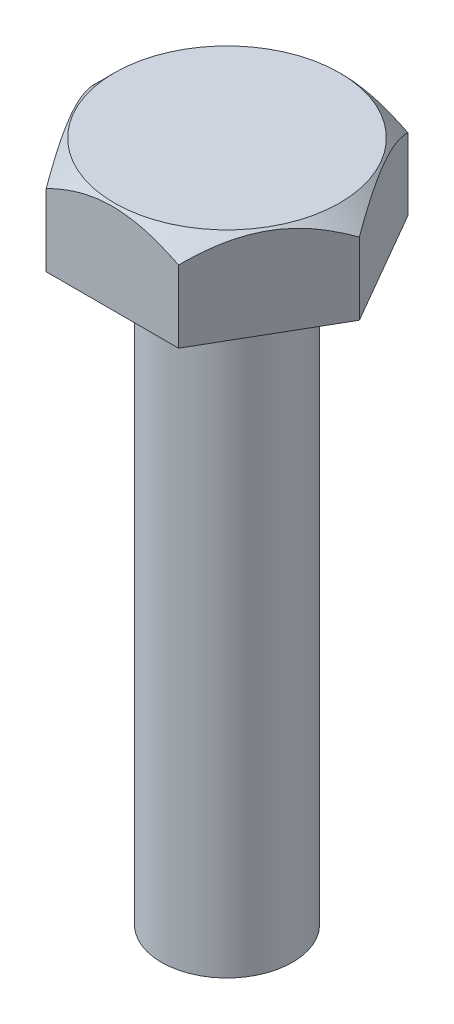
ISO-10303-21;
HEADER;
FILE_DESCRIPTION(('STEP AP214'),'2;1');
FILE_NAME('part.step','',(''),(''),'','','');
FILE_SCHEMA(('AUTOMOTIVE_DESIGN { 1 0 10303 214 1 1 1 1 }'));
ENDSEC;
DATA;
#1=APPLICATION_CONTEXT('core data for automotive mechanical design processes');
#2=APPLICATION_PROTOCOL_DEFINITION('international standard','automotive_design',2000,#1);
#3=PRODUCT_CONTEXT('',#1,'mechanical');
#4=PRODUCT('Part','Part','',(#3));
#5=PRODUCT_RELATED_PRODUCT_CATEGORY('part','',(#4));
#6=PRODUCT_DEFINITION_FORMATION('','',#4);
#7=PRODUCT_DEFINITION_CONTEXT('part definition',#1,'design');
#8=PRODUCT_DEFINITION('design','',#6,#7);
#9=PRODUCT_DEFINITION_SHAPE('','',#8);
#10=(LENGTH_UNIT() NAMED_UNIT(*) SI_UNIT(.MILLI.,.METRE.));
#11=(NAMED_UNIT(*) PLANE_ANGLE_UNIT() SI_UNIT($,.RADIAN.));
#12=(NAMED_UNIT(*) SI_UNIT($,.STERADIAN.) SOLID_ANGLE_UNIT());
#13=UNCERTAINTY_MEASURE_WITH_UNIT(LENGTH_MEASURE(1.E-05),#10,'distance_accuracy_value','');
#14=(GEOMETRIC_REPRESENTATION_CONTEXT(3) GLOBAL_UNCERTAINTY_ASSIGNED_CONTEXT((#13)) GLOBAL_UNIT_ASSIGNED_CONTEXT((#10,
#11,#12)) REPRESENTATION_CONTEXT('',''));
#15=CARTESIAN_POINT('',(0.,0.,0.));
#16=DIRECTION('',(0.,0.,1.));
#17=DIRECTION('',(1.,0.,0.));
#18=AXIS2_PLACEMENT_3D('',#15,#16,#17);
#19=CARTESIAN_POINT('',(4.04145188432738,20.8,0.));
#20=DIRECTION('',(-0.866025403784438,0.,0.5));
#21=DIRECTION('',(0.5,0.,0.866025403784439));
#22=AXIS2_PLACEMENT_3D('',#19,#20,#21);
#23=PLANE('',#22);
#24=CARTESIAN_POINT('',(4.04156735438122,20.1998845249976,0.000199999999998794));
#25=CARTESIAN_POINT('',(3.9721070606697,20.2692840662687,-0.12010875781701));
#26=CARTESIAN_POINT('',(3.90148531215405,20.3346075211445,-0.242429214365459));
#27=CARTESIAN_POINT('',(3.75747991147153,20.4542129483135,-0.491853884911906));
#28=CARTESIAN_POINT('',(3.68408256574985,20.5084283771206,-0.61898181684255));
#29=CARTESIAN_POINT('',(3.53608035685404,20.6013003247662,-0.875329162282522));
#30=CARTESIAN_POINT('',(3.46151318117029,20.6401902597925,-1.00448329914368));
#31=CARTESIAN_POINT('',(3.310737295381,20.7001080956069,-1.26563479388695));
#32=CARTESIAN_POINT('',(3.2345331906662,20.7211807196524,-1.39762417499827));
#33=CARTESIAN_POINT('',(3.10319782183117,20.7401938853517,-1.62510370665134));
#34=CARTESIAN_POINT('',(3.04823615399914,20.7430083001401,-1.72030010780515));
#35=CARTESIAN_POINT('',(2.93840222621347,20.7382653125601,-1.91053805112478));
#36=CARTESIAN_POINT('',(2.88353000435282,20.730704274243,-2.00557952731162));
#37=CARTESIAN_POINT('',(2.77430542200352,20.7056421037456,-2.19476205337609));
#38=CARTESIAN_POINT('',(2.71995371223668,20.6881298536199,-2.28890197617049));
#39=CARTESIAN_POINT('',(2.61218376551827,20.6441211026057,-2.47556499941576));
#40=CARTESIAN_POINT('',(2.55876545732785,20.6176252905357,-2.56808822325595));
#41=CARTESIAN_POINT('',(2.46393368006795,20.5631120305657,-2.73234167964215));
#42=CARTESIAN_POINT('',(2.42231028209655,20.5365276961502,-2.80443551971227));
#43=CARTESIAN_POINT('',(2.33981072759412,20.4790746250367,-2.94732893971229));
#44=CARTESIAN_POINT('',(2.29893459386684,20.4482057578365,-3.01812848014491));
#45=CARTESIAN_POINT('',(2.21805834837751,20.3828756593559,-3.15821024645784));
#46=CARTESIAN_POINT('',(2.17805593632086,20.348425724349,-3.22749645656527));
#47=CARTESIAN_POINT('',(2.09879193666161,20.2763859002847,-3.36478573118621));
#48=CARTESIAN_POINT('',(2.05952991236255,20.2387979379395,-3.43278955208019));
#49=CARTESIAN_POINT('',(2.02061047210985,20.1998845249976,-3.5002));
#50=B_SPLINE_CURVE_WITH_KNOTS('',3,(#24,#25,#26,#27,#28,#29,#30,#31,#32,#33,#34,#35,#36,#37,#38,
#39,#40,#41,#42,#43,#44,#45,#46,#47,#48,#49),.UNSPECIFIED.,.F.,.F.,(4,2,2,2,2,2,2,2,2,2,2,2,4),
(0.,0.466195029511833,0.93510605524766,1.39657035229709,1.85687285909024,2.18628459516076,
2.5158117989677,2.84570789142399,3.17557869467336,3.43762138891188,3.6996720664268,
3.96091985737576,4.22200840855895),.UNSPECIFIED.);
#51=CARTESIAN_POINT('',(4.04145188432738,20.2,0.));
#52=VERTEX_POINT('',#51);
#53=CARTESIAN_POINT('',(2.02072594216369,20.2,-3.5));
#54=VERTEX_POINT('',#53);
#55=EDGE_CURVE('E88',#52,#54,#50,.T.);
#56=ORIENTED_EDGE('',*,*,#55,.F.);
#57=DIRECTION('',(0.,-1.,0.));
#58=VECTOR('',#57,1.);
#59=CARTESIAN_POINT('',(4.04145188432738,20.8,0.));
#60=LINE('',#59,#58);
#61=CARTESIAN_POINT('',(4.04145188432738,18.,0.));
#62=VERTEX_POINT('',#61);
#63=EDGE_CURVE('E59',#52,#62,#60,.T.);
#64=ORIENTED_EDGE('',*,*,#63,.T.);
#65=DIRECTION('',(-0.5,0.,-0.866025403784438));
#66=VECTOR('',#65,1.);
#67=CARTESIAN_POINT('',(4.04145188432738,18.,0.));
#68=LINE('',#67,#66);
#69=CARTESIAN_POINT('',(2.02072594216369,18.,-3.5));
#70=VERTEX_POINT('',#69);
#71=EDGE_CURVE('E95',#62,#70,#68,.T.);
#72=ORIENTED_EDGE('',*,*,#71,.T.);
#73=DIRECTION('',(0.,-1.,0.));
#74=VECTOR('',#73,1.);
#75=CARTESIAN_POINT('',(2.02072594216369,20.8,-3.5));
#76=LINE('',#75,#74);
#77=EDGE_CURVE('E101',#54,#70,#76,.T.);
#78=ORIENTED_EDGE('',*,*,#77,.F.);
#79=EDGE_LOOP('',(#56,#64,#72,#78));
#80=FACE_BOUND('',#79,.T.);
#81=ADVANCED_FACE('F36',(#80),#23,.F.);
#82=CARTESIAN_POINT('',(2.02072594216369,20.8,-3.5));
#83=DIRECTION('',(0.,0.,1.));
#84=DIRECTION('',(1.,0.,0.));
#85=AXIS2_PLACEMENT_3D('',#82,#83,#84);
#86=PLANE('',#85);
#87=CARTESIAN_POINT('',(-4.19349109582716,18.7792758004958,-3.5));
#88=CARTESIAN_POINT('',(-4.09208669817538,18.8571097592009,-3.5));
#89=CARTESIAN_POINT('',(-3.99013324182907,18.9342396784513,-3.5));
#90=CARTESIAN_POINT('',(-3.78490475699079,19.086770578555,-3.5));
#91=CARTESIAN_POINT('',(-3.68162941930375,19.1621711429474,-3.5));
#92=CARTESIAN_POINT('',(-3.47277876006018,19.3114591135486,-3.5));
#93=CARTESIAN_POINT('',(-3.36719183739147,19.3853303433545,-3.5));
#94=CARTESIAN_POINT('',(-3.15425614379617,19.530479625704,-3.5));
#95=CARTESIAN_POINT('',(-3.04690749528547,19.6017578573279,-3.5));
#96=CARTESIAN_POINT('',(-2.82336801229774,19.7454955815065,-3.5));
#97=CARTESIAN_POINT('',(-2.70704438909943,19.8177496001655,-3.5));
#98=CARTESIAN_POINT('',(-2.47166706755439,19.9577405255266,-3.5));
#99=CARTESIAN_POINT('',(-2.3526129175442,20.0254766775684,-3.5));
#100=CARTESIAN_POINT('',(-2.11174739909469,20.1549869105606,-3.5));
#101=CARTESIAN_POINT('',(-1.9899455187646,20.2167784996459,-3.5));
#102=CARTESIAN_POINT('',(-1.74291320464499,20.3330152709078,-3.5));
#103=CARTESIAN_POINT('',(-1.61768441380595,20.3874639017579,-3.5));
#104=CARTESIAN_POINT('',(-1.37579906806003,20.482239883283,-3.5));
#105=CARTESIAN_POINT('',(-1.25948120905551,20.5234228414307,-3.5));
#106=CARTESIAN_POINT('',(-1.02390221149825,20.5964761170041,-3.5));
#107=CARTESIAN_POINT('',(-0.904640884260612,20.6283458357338,-3.5));
#108=CARTESIAN_POINT('',(-0.665952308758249,20.6805243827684,-3.5));
#109=CARTESIAN_POINT('',(-0.546571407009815,20.7010416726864,-3.5));
#110=CARTESIAN_POINT('',(-0.306352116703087,20.7300907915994,-3.5));
#111=CARTESIAN_POINT('',(-0.185514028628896,20.7386250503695,-3.5));
#112=CARTESIAN_POINT('',(0.0512281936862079,20.7429926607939,-3.5));
#113=CARTESIAN_POINT('',(0.167122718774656,20.7393527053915,-3.5));
#114=CARTESIAN_POINT('',(0.397996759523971,20.7207766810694,-3.5));
#115=CARTESIAN_POINT('',(0.512976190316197,20.7058395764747,-3.5));
#116=CARTESIAN_POINT('',(0.743135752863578,20.665256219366,-3.5));
#117=CARTESIAN_POINT('',(0.858282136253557,20.6394217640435,-3.5));
#118=CARTESIAN_POINT('',(1.08604290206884,20.5784699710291,-3.5));
#119=CARTESIAN_POINT('',(1.19865743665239,20.5433531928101,-3.5));
#120=CARTESIAN_POINT('',(1.42803237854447,20.4629566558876,-3.5));
#121=CARTESIAN_POINT('',(1.54461737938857,20.4171820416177,-3.5));
#122=CARTESIAN_POINT('',(1.77477031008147,20.3185716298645,-3.5));
#123=CARTESIAN_POINT('',(1.88833725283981,20.2657335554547,-3.5));
#124=CARTESIAN_POINT('',(2.11301559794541,20.1542411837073,-3.5));
#125=CARTESIAN_POINT('',(2.22411783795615,20.0955685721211,-3.5));
#126=CARTESIAN_POINT('',(2.44377531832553,19.973701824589,-3.5));
#127=CARTESIAN_POINT('',(2.55233094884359,19.9105083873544,-3.5));
#128=CARTESIAN_POINT('',(2.76191944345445,19.783695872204,-3.5));
#129=CARTESIAN_POINT('',(2.86305896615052,19.7202521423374,-3.5));
#130=CARTESIAN_POINT('',(3.06360047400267,19.5906675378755,-3.5));
#131=CARTESIAN_POINT('',(3.16300232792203,19.5245264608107,-3.5));
#132=CARTESIAN_POINT('',(3.35949586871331,19.3905676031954,-3.5));
#133=CARTESIAN_POINT('',(3.45659970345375,19.3227675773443,-3.5));
#134=CARTESIAN_POINT('',(3.64947574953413,19.1853525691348,-3.5));
#135=CARTESIAN_POINT('',(3.74524832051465,19.1157380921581,-3.5));
#136=CARTESIAN_POINT('',(3.84046254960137,19.0453810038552,-3.5));
#137=B_SPLINE_CURVE_WITH_KNOTS('',3,(#87,#88,#89,#90,#91,#92,#93,#94,#95,#96,#97,#98,#99,#100,
#101,#102,#103,#104,#105,#106,#107,#108,#109,#110,#111,#112,#113,#114,#115,#116,#117,#118,#119,
#120,#121,#122,#123,#124,#125,#126,#127,#128,#129,#130,#131,#132,#133,#134,#135,#136),
.UNSPECIFIED.,.F.,.F.,(4,2,2,2,2,2,2,2,2,2,2,2,2,2,2,2,2,2,2,2,2,2,2,2,4),(0.,0.383502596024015,
0.767096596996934,1.15365209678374,1.54018084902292,1.95091122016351,2.36171002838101,
2.77125931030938,3.1806155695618,3.55047538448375,3.92035897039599,4.28320370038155,
4.64597484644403,4.99325794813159,5.34057289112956,5.69414898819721,6.04770377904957,
6.42316312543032,6.798743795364,7.17554301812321,7.55228413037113,7.91040820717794,
8.26855921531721,8.62383088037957,8.97900462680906),.UNSPECIFIED.);
#138=CARTESIAN_POINT('',(-2.02072594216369,20.2,-3.5));
#139=VERTEX_POINT('',#138);
#140=EDGE_CURVE('E91',#54,#139,#137,.F.);
#141=ORIENTED_EDGE('',*,*,#140,.F.);
#142=ORIENTED_EDGE('',*,*,#77,.T.);
#143=DIRECTION('',(-1.,0.,0.));
#144=VECTOR('',#143,1.);
#145=CARTESIAN_POINT('',(2.02072594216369,18.,-3.5));
#146=LINE('',#145,#144);
#147=CARTESIAN_POINT('',(-2.02072594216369,18.,-3.5));
#148=VERTEX_POINT('',#147);
#149=EDGE_CURVE('E129',#70,#148,#146,.T.);
#150=ORIENTED_EDGE('',*,*,#149,.T.);
#151=DIRECTION('',(0.,-1.,0.));
#152=VECTOR('',#151,1.);
#153=CARTESIAN_POINT('',(-2.02072594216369,20.8,-3.5));
#154=LINE('',#153,#152);
#155=EDGE_CURVE('E103',#139,#148,#154,.T.);
#156=ORIENTED_EDGE('',*,*,#155,.F.);
#157=EDGE_LOOP('',(#141,#142,#150,#156));
#158=FACE_BOUND('',#157,.T.);
#159=ADVANCED_FACE('F99',(#158),#86,.F.);
#160=CARTESIAN_POINT('',(-2.02072594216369,20.8,-3.5));
#161=DIRECTION('',(0.866025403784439,0.,0.5));
#162=DIRECTION('',(0.5,0.,-0.866025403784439));
#163=AXIS2_PLACEMENT_3D('',#160,#161,#162);
#164=PLANE('',#163);
#165=CARTESIAN_POINT('',(-2.02061047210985,20.1998845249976,-3.5002));
#166=CARTESIAN_POINT('',(-2.09007076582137,20.2692840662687,-3.37989124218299));
#167=CARTESIAN_POINT('',(-2.16069251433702,20.3346075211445,-3.25757078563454));
#168=CARTESIAN_POINT('',(-2.30469791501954,20.4542129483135,-3.0081461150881));
#169=CARTESIAN_POINT('',(-2.37809526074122,20.5084283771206,-2.88101818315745));
#170=CARTESIAN_POINT('',(-2.52609746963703,20.6013003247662,-2.62467083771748));
#171=CARTESIAN_POINT('',(-2.60066464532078,20.6401902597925,-2.49551670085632));
#172=CARTESIAN_POINT('',(-2.75144053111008,20.7001080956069,-2.23436520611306));
#173=CARTESIAN_POINT('',(-2.82764463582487,20.7211807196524,-2.10237582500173));
#174=CARTESIAN_POINT('',(-2.9589800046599,20.7401938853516,-1.87489629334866));
#175=CARTESIAN_POINT('',(-3.01394167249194,20.7430083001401,-1.77969989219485));
#176=CARTESIAN_POINT('',(-3.1237756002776,20.7382653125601,-1.58946194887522));
#177=CARTESIAN_POINT('',(-3.17864782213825,20.730704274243,-1.49442047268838));
#178=CARTESIAN_POINT('',(-3.28787240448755,20.7056421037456,-1.30523794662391));
#179=CARTESIAN_POINT('',(-3.34222411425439,20.6881298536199,-1.21109802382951));
#180=CARTESIAN_POINT('',(-3.4499940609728,20.6441211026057,-1.02443500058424));
#181=CARTESIAN_POINT('',(-3.50341236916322,20.6176252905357,-0.931911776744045));
#182=CARTESIAN_POINT('',(-3.59824414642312,20.5631120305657,-0.767658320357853));
#183=CARTESIAN_POINT('',(-3.63986754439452,20.5365276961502,-0.695564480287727));
#184=CARTESIAN_POINT('',(-3.72236709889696,20.4790746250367,-0.552671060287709));
#185=CARTESIAN_POINT('',(-3.76324323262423,20.4482057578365,-0.481871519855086));
#186=CARTESIAN_POINT('',(-3.84411947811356,20.3828756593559,-0.341789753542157));
#187=CARTESIAN_POINT('',(-3.88412189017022,20.348425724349,-0.272503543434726));
#188=CARTESIAN_POINT('',(-3.96338588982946,20.2763859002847,-0.135214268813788));
#189=CARTESIAN_POINT('',(-4.00264791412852,20.2387979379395,-0.0672104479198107));
#190=CARTESIAN_POINT('',(-4.04156735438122,20.1998845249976,0.00020000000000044));
#191=B_SPLINE_CURVE_WITH_KNOTS('',3,(#165,#166,#167,#168,#169,#170,#171,#172,#173,#174,#175,
#176,#177,#178,#179,#180,#181,#182,#183,#184,#185,#186,#187,#188,#189,#190),.UNSPECIFIED.,.F.,
.F.,(4,2,2,2,2,2,2,2,2,2,2,2,4),(0.,0.466195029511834,0.935106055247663,1.3965703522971,
1.85687285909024,2.18628459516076,2.51581179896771,2.84570789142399,3.17557869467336,
3.43762138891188,3.69967206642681,3.96091985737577,4.22200840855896),.UNSPECIFIED.);
#192=CARTESIAN_POINT('',(-4.04145188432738,20.2,0.));
#193=VERTEX_POINT('',#192);
#194=EDGE_CURVE('E104',#139,#193,#191,.T.);
#195=ORIENTED_EDGE('',*,*,#194,.F.);
#196=ORIENTED_EDGE('',*,*,#155,.T.);
#197=DIRECTION('',(-0.5,0.,0.866025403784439));
#198=VECTOR('',#197,1.);
#199=CARTESIAN_POINT('',(-2.02072594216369,18.,-3.5));
#200=LINE('',#199,#198);
#201=CARTESIAN_POINT('',(-4.04145188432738,18.,0.));
#202=VERTEX_POINT('',#201);
#203=EDGE_CURVE('E126',#148,#202,#200,.T.);
#204=ORIENTED_EDGE('',*,*,#203,.T.);
#205=DIRECTION('',(0.,-1.,0.));
#206=VECTOR('',#205,1.);
#207=CARTESIAN_POINT('',(-4.04145188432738,20.8,0.));
#208=LINE('',#207,#206);
#209=EDGE_CURVE('E109',#193,#202,#208,.T.);
#210=ORIENTED_EDGE('',*,*,#209,.F.);
#211=EDGE_LOOP('',(#195,#196,#204,#210));
#212=FACE_BOUND('',#211,.T.);
#213=ADVANCED_FACE('F181',(#212),#164,.F.);
#214=CARTESIAN_POINT('',(-4.04145188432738,20.8,0.));
#215=DIRECTION('',(0.866025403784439,0.,-0.5));
#216=DIRECTION('',(-0.5,0.,-0.866025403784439));
#217=AXIS2_PLACEMENT_3D('',#214,#215,#216);
#218=PLANE('',#217);
#219=CARTESIAN_POINT('',(-4.04156735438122,20.1998845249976,-0.000200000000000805));
#220=CARTESIAN_POINT('',(-3.9721070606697,20.2692840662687,0.120108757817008));
#221=CARTESIAN_POINT('',(-3.90148531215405,20.3346075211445,0.242429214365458));
#222=CARTESIAN_POINT('',(-3.75747991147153,20.4542129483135,0.491853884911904));
#223=CARTESIAN_POINT('',(-3.68408256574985,20.5084283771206,0.618981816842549));
#224=CARTESIAN_POINT('',(-3.53608035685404,20.6013003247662,0.875329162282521));
#225=CARTESIAN_POINT('',(-3.46151318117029,20.6401902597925,1.00448329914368));
#226=CARTESIAN_POINT('',(-3.310737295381,20.7001080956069,1.26563479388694));
#227=CARTESIAN_POINT('',(-3.2345331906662,20.7211807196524,1.39762417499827));
#228=CARTESIAN_POINT('',(-3.10319782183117,20.7401938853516,1.62510370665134));
#229=CARTESIAN_POINT('',(-3.04823615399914,20.7430083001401,1.72030010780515));
#230=CARTESIAN_POINT('',(-2.93840222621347,20.7382653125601,1.91053805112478));
#231=CARTESIAN_POINT('',(-2.88353000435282,20.730704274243,2.00557952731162));
#232=CARTESIAN_POINT('',(-2.77430542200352,20.7056421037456,2.19476205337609));
#233=CARTESIAN_POINT('',(-2.71995371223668,20.6881298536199,2.28890197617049));
#234=CARTESIAN_POINT('',(-2.61218376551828,20.6441211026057,2.47556499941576));
#235=CARTESIAN_POINT('',(-2.55876545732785,20.6176252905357,2.56808822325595));
#236=CARTESIAN_POINT('',(-2.46393368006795,20.5631120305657,2.73234167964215));
#237=CARTESIAN_POINT('',(-2.42231028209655,20.5365276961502,2.80443551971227));
#238=CARTESIAN_POINT('',(-2.33981072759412,20.4790746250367,2.94732893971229));
#239=CARTESIAN_POINT('',(-2.29893459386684,20.4482057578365,3.01812848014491));
#240=CARTESIAN_POINT('',(-2.21805834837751,20.3828756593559,3.15821024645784));
#241=CARTESIAN_POINT('',(-2.17805593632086,20.348425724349,3.22749645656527));
#242=CARTESIAN_POINT('',(-2.09879193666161,20.2763859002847,3.36478573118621));
#243=CARTESIAN_POINT('',(-2.05952991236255,20.2387979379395,3.43278955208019));
#244=CARTESIAN_POINT('',(-2.02061047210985,20.1998845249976,3.5002));
#245=B_SPLINE_CURVE_WITH_KNOTS('',3,(#219,#220,#221,#222,#223,#224,#225,#226,#227,#228,#229,
#230,#231,#232,#233,#234,#235,#236,#237,#238,#239,#240,#241,#242,#243,#244),.UNSPECIFIED.,.F.,
.F.,(4,2,2,2,2,2,2,2,2,2,2,2,4),(0.,0.466195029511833,0.935106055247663,1.3965703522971,
1.85687285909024,2.18628459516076,2.51581179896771,2.84570789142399,3.17557869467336,
3.43762138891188,3.6996720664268,3.96091985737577,4.22200840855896),.UNSPECIFIED.);
#246=CARTESIAN_POINT('',(-2.02072594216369,20.2,3.5));
#247=VERTEX_POINT('',#246);
#248=EDGE_CURVE('E170',#193,#247,#245,.T.);
#249=ORIENTED_EDGE('',*,*,#248,.F.);
#250=ORIENTED_EDGE('',*,*,#209,.T.);
#251=DIRECTION('',(0.5,0.,0.866025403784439));
#252=VECTOR('',#251,1.);
#253=CARTESIAN_POINT('',(-4.04145188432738,18.,0.));
#254=LINE('',#253,#252);
#255=CARTESIAN_POINT('',(-2.02072594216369,18.,3.5));
#256=VERTEX_POINT('',#255);
#257=EDGE_CURVE('E123',#202,#256,#254,.T.);
#258=ORIENTED_EDGE('',*,*,#257,.T.);
#259=DIRECTION('',(0.,-1.,0.));
#260=VECTOR('',#259,1.);
#261=CARTESIAN_POINT('',(-2.02072594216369,20.8,3.5));
#262=LINE('',#261,#260);
#263=EDGE_CURVE('E113',#247,#256,#262,.T.);
#264=ORIENTED_EDGE('',*,*,#263,.F.);
#265=EDGE_LOOP('',(#249,#250,#258,#264));
#266=FACE_BOUND('',#265,.T.);
#267=ADVANCED_FACE('F184',(#266),#218,.F.);
#268=CARTESIAN_POINT('',(-2.02072594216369,20.8,3.5));
#269=DIRECTION('',(0.,0.,-1.));
#270=DIRECTION('',(-1.,0.,0.));
#271=AXIS2_PLACEMENT_3D('',#268,#269,#270);
#272=PLANE('',#271);
#273=CARTESIAN_POINT('',(-4.19349109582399,18.7792758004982,3.5));
#274=CARTESIAN_POINT('',(-4.0920866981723,18.8571097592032,3.5));
#275=CARTESIAN_POINT('',(-3.99013324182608,18.9342396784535,3.5));
#276=CARTESIAN_POINT('',(-3.78490475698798,19.086770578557,3.5));
#277=CARTESIAN_POINT('',(-3.68162941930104,19.1621711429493,3.5));
#278=CARTESIAN_POINT('',(-3.47277876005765,19.3114591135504,3.5));
#279=CARTESIAN_POINT('',(-3.36719183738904,19.3853303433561,3.5));
#280=CARTESIAN_POINT('',(-3.15425614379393,19.5304796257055,3.5));
#281=CARTESIAN_POINT('',(-3.04690749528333,19.6017578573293,3.5));
#282=CARTESIAN_POINT('',(-2.82336801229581,19.7454955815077,3.5));
#283=CARTESIAN_POINT('',(-2.70704438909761,19.8177496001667,3.5));
#284=CARTESIAN_POINT('',(-2.4716670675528,19.9577405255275,3.5));
#285=CARTESIAN_POINT('',(-2.35261291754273,20.0254766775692,3.5));
#286=CARTESIAN_POINT('',(-2.11174739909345,20.1549869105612,3.5));
#287=CARTESIAN_POINT('',(-1.98994551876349,20.2167784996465,3.5));
#288=CARTESIAN_POINT('',(-1.74291320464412,20.3330152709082,3.5));
#289=CARTESIAN_POINT('',(-1.61768441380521,20.3874639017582,3.5));
#290=CARTESIAN_POINT('',(-1.37579906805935,20.4822398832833,3.5));
#291=CARTESIAN_POINT('',(-1.25948120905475,20.523422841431,3.5));
#292=CARTESIAN_POINT('',(-1.02390221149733,20.5964761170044,3.5));
#293=CARTESIAN_POINT('',(-0.904640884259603,20.628345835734,3.5));
#294=CARTESIAN_POINT('',(-0.665952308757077,20.6805243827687,3.5));
#295=CARTESIAN_POINT('',(-0.546571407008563,20.7010416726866,3.5));
#296=CARTESIAN_POINT('',(-0.306352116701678,20.7300907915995,3.5));
#297=CARTESIAN_POINT('',(-0.185514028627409,20.7386250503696,3.5));
#298=CARTESIAN_POINT('',(0.0512281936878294,20.7429926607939,3.5));
#299=CARTESIAN_POINT('',(0.167122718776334,20.7393527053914,3.5));
#300=CARTESIAN_POINT('',(0.397996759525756,20.7207766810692,3.5));
#301=CARTESIAN_POINT('',(0.512976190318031,20.7058395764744,3.5));
#302=CARTESIAN_POINT('',(0.743135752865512,20.6652562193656,3.5));
#303=CARTESIAN_POINT('',(0.858282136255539,20.639421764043,3.5));
#304=CARTESIAN_POINT('',(1.08604290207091,20.5784699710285,3.5));
#305=CARTESIAN_POINT('',(1.19865743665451,20.5433531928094,3.5));
#306=CARTESIAN_POINT('',(1.42803237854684,20.4629566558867,3.5));
#307=CARTESIAN_POINT('',(1.54461737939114,20.4171820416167,3.5));
#308=CARTESIAN_POINT('',(1.77477031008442,20.3185716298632,3.5));
#309=CARTESIAN_POINT('',(1.88833725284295,20.2657335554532,3.5));
#310=CARTESIAN_POINT('',(2.11301559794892,20.1542411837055,3.5));
#311=CARTESIAN_POINT('',(2.22411783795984,20.0955685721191,3.5));
#312=CARTESIAN_POINT('',(2.44377531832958,19.9737018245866,3.5));
#313=CARTESIAN_POINT('',(2.55233094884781,19.910508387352,3.5));
#314=CARTESIAN_POINT('',(2.761919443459,19.7836958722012,3.5));
#315=CARTESIAN_POINT('',(2.86305896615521,19.7202521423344,3.5));
#316=CARTESIAN_POINT('',(3.06360047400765,19.5906675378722,3.5));
#317=CARTESIAN_POINT('',(3.16300232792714,19.5245264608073,3.5));
#318=CARTESIAN_POINT('',(3.35949586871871,19.3905676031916,3.5));
#319=CARTESIAN_POINT('',(3.45659970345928,19.3227675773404,3.5));
#320=CARTESIAN_POINT('',(3.64947574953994,19.1853525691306,3.5));
#321=CARTESIAN_POINT('',(3.7452483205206,19.1157380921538,3.5));
#322=CARTESIAN_POINT('',(3.84046254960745,19.0453810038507,3.5));
#323=B_SPLINE_CURVE_WITH_KNOTS('',3,(#273,#274,#275,#276,#277,#278,#279,#280,#281,#282,#283,
#284,#285,#286,#287,#288,#289,#290,#291,#292,#293,#294,#295,#296,#297,#298,#299,#300,#301,#302,
#303,#304,#305,#306,#307,#308,#309,#310,#311,#312,#313,#314,#315,#316,#317,#318,#319,#320,#321,
#322),.UNSPECIFIED.,.F.,.F.,(4,2,2,2,2,2,2,2,2,2,2,2,2,2,2,2,2,2,2,2,2,2,2,2,4),(0.,
0.383502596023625,0.767096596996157,1.15365209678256,1.54018084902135,1.9509112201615,
2.36171002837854,2.77125931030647,3.18061556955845,3.55047538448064,3.92035897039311,
4.28320370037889,4.64597484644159,4.99325794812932,5.34057289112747,5.69414898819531,
6.04770377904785,6.42316312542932,6.79874379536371,7.17554301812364,7.55228413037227,
7.91040820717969,8.26855921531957,8.62383088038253,8.97900462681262),.UNSPECIFIED.);
#324=CARTESIAN_POINT('',(2.02072594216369,20.2,3.5));
#325=VERTEX_POINT('',#324);
#326=EDGE_CURVE('E51',#247,#325,#323,.T.);
#327=ORIENTED_EDGE('',*,*,#326,.F.);
#328=ORIENTED_EDGE('',*,*,#263,.T.);
#329=DIRECTION('',(1.,0.,0.));
#330=VECTOR('',#329,1.);
#331=CARTESIAN_POINT('',(-2.02072594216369,18.,3.5));
#332=LINE('',#331,#330);
#333=CARTESIAN_POINT('',(2.02072594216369,18.,3.5));
#334=VERTEX_POINT('',#333);
#335=EDGE_CURVE('E120',#256,#334,#332,.T.);
#336=ORIENTED_EDGE('',*,*,#335,.T.);
#337=DIRECTION('',(0.,-1.,0.));
#338=VECTOR('',#337,1.);
#339=CARTESIAN_POINT('',(2.02072594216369,20.8,3.5));
#340=LINE('',#339,#338);
#341=EDGE_CURVE('E115',#325,#334,#340,.T.);
#342=ORIENTED_EDGE('',*,*,#341,.F.);
#343=EDGE_LOOP('',(#327,#328,#336,#342));
#344=FACE_BOUND('',#343,.T.);
#345=ADVANCED_FACE('F219',(#344),#272,.F.);
#346=CARTESIAN_POINT('',(2.02072594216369,20.8,3.5));
#347=DIRECTION('',(-0.866025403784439,0.,-0.5));
#348=DIRECTION('',(-0.5,0.,0.866025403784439));
#349=AXIS2_PLACEMENT_3D('',#346,#347,#348);
#350=PLANE('',#349);
#351=CARTESIAN_POINT('',(2.02061047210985,20.1998845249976,3.5002));
#352=CARTESIAN_POINT('',(2.09007076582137,20.2692840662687,3.37989124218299));
#353=CARTESIAN_POINT('',(2.16069251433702,20.3346075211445,3.25757078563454));
#354=CARTESIAN_POINT('',(2.30469791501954,20.4542129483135,3.00814611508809));
#355=CARTESIAN_POINT('',(2.37809526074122,20.5084283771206,2.88101818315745));
#356=CARTESIAN_POINT('',(2.52609746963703,20.6013003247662,2.62467083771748));
#357=CARTESIAN_POINT('',(2.60066464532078,20.6401902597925,2.49551670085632));
#358=CARTESIAN_POINT('',(2.75144053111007,20.7001080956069,2.23436520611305));
#359=CARTESIAN_POINT('',(2.82764463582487,20.7211807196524,2.10237582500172));
#360=CARTESIAN_POINT('',(2.9589800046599,20.7401938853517,1.87489629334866));
#361=CARTESIAN_POINT('',(3.01394167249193,20.7430083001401,1.77969989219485));
#362=CARTESIAN_POINT('',(3.1237756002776,20.7382653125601,1.58946194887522));
#363=CARTESIAN_POINT('',(3.17864782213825,20.730704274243,1.49442047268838));
#364=CARTESIAN_POINT('',(3.28787240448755,20.7056421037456,1.30523794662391));
#365=CARTESIAN_POINT('',(3.34222411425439,20.6881298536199,1.21109802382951));
#366=CARTESIAN_POINT('',(3.4499940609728,20.6441211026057,1.02443500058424));
#367=CARTESIAN_POINT('',(3.50341236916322,20.6176252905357,0.931911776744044));
#368=CARTESIAN_POINT('',(3.59824414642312,20.5631120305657,0.767658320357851));
#369=CARTESIAN_POINT('',(3.63986754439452,20.5365276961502,0.695564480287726));
#370=CARTESIAN_POINT('',(3.72236709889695,20.4790746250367,0.552671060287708));
#371=CARTESIAN_POINT('',(3.76324323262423,20.4482057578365,0.481871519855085));
#372=CARTESIAN_POINT('',(3.84411947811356,20.3828756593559,0.341789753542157));
#373=CARTESIAN_POINT('',(3.88412189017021,20.348425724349,0.272503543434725));
#374=CARTESIAN_POINT('',(3.96338588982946,20.2763859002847,0.135214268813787));
#375=CARTESIAN_POINT('',(4.00264791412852,20.2387979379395,0.0672104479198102));
#376=CARTESIAN_POINT('',(4.04156735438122,20.1998845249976,-0.000200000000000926));
#377=B_SPLINE_CURVE_WITH_KNOTS('',3,(#351,#352,#353,#354,#355,#356,#357,#358,#359,#360,#361,
#362,#363,#364,#365,#366,#367,#368,#369,#370,#371,#372,#373,#374,#375,#376),.UNSPECIFIED.,.F.,
.F.,(4,2,2,2,2,2,2,2,2,2,2,2,4),(0.,0.466195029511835,0.935106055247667,1.3965703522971,
1.85687285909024,2.18628459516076,2.51581179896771,2.84570789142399,3.17557869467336,
3.43762138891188,3.69967206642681,3.96091985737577,4.22200840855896),.UNSPECIFIED.);
#378=EDGE_CURVE('E93',#325,#52,#377,.T.);
#379=ORIENTED_EDGE('',*,*,#378,.F.);
#380=ORIENTED_EDGE('',*,*,#341,.T.);
#381=DIRECTION('',(0.5,0.,-0.866025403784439));
#382=VECTOR('',#381,1.);
#383=CARTESIAN_POINT('',(2.02072594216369,18.,3.5));
#384=LINE('',#383,#382);
#385=EDGE_CURVE('E118',#334,#62,#384,.T.);
#386=ORIENTED_EDGE('',*,*,#385,.T.);
#387=ORIENTED_EDGE('',*,*,#63,.F.);
#388=EDGE_LOOP('',(#379,#380,#386,#387));
#389=FACE_BOUND('',#388,.T.);
#390=ADVANCED_FACE('F228',(#389),#350,.F.);
#391=CARTESIAN_POINT('',(0.,18.,0.));
#392=DIRECTION('',(0.,-1.,0.));
#393=DIRECTION('',(0.,0.,-1.));
#394=AXIS2_PLACEMENT_3D('',#391,#392,#393);
#395=CYLINDRICAL_SURFACE('',#394,2.);
#396=CARTESIAN_POINT('',(0.,18.,0.));
#397=DIRECTION('',(0.,1.,0.));
#398=DIRECTION('',(0.,0.,1.));
#399=AXIS2_PLACEMENT_3D('',#396,#397,#398);
#400=CIRCLE('',#399,2.);
#401=CARTESIAN_POINT('',(0.,18.,2.));
#402=VERTEX_POINT('',#401);
#403=EDGE_CURVE('E11',#402,#402,#400,.T.);
#404=ORIENTED_EDGE('',*,*,#403,.F.);
#405=EDGE_LOOP('',(#404));
#406=FACE_BOUND('',#405,.T.);
#407=CARTESIAN_POINT('',(0.,0.,0.));
#408=DIRECTION('',(0.,1.,0.));
#409=DIRECTION('',(0.,0.,1.));
#410=AXIS2_PLACEMENT_3D('',#407,#408,#409);
#411=CIRCLE('',#410,2.);
#412=CARTESIAN_POINT('',(0.,0.,2.));
#413=VERTEX_POINT('',#412);
#414=EDGE_CURVE('E40',#413,#413,#411,.T.);
#415=ORIENTED_EDGE('',*,*,#414,.T.);
#416=EDGE_LOOP('',(#415));
#417=FACE_BOUND('',#416,.T.);
#418=ADVANCED_FACE('F38',(#406,#417),#395,.T.);
#419=CARTESIAN_POINT('',(0.,0.,0.));
#420=DIRECTION('',(0.,1.,0.));
#421=DIRECTION('',(0.,0.,1.));
#422=AXIS2_PLACEMENT_3D('',#419,#420,#421);
#423=PLANE('',#422);
#424=ORIENTED_EDGE('',*,*,#414,.F.);
#425=EDGE_LOOP('',(#424));
#426=FACE_BOUND('',#425,.T.);
#427=ADVANCED_FACE('F257',(#426),#423,.F.);
#428=CARTESIAN_POINT('',(0.,18.,0.));
#429=DIRECTION('',(0.,1.,0.));
#430=DIRECTION('',(0.,0.,1.));
#431=AXIS2_PLACEMENT_3D('',#428,#429,#430);
#432=PLANE('',#431);
#433=ORIENTED_EDGE('',*,*,#403,.T.);
#434=EDGE_LOOP('',(#433));
#435=FACE_BOUND('',#434,.T.);
#436=ORIENTED_EDGE('',*,*,#71,.F.);
#437=ORIENTED_EDGE('',*,*,#385,.F.);
#438=ORIENTED_EDGE('',*,*,#335,.F.);
#439=ORIENTED_EDGE('',*,*,#257,.F.);
#440=ORIENTED_EDGE('',*,*,#203,.F.);
#441=ORIENTED_EDGE('',*,*,#149,.F.);
#442=EDGE_LOOP('',(#436,#437,#438,#439,#440,#441));
#443=FACE_BOUND('',#442,.T.);
#444=ADVANCED_FACE('F148',(#435,#443),#432,.F.);
#445=CARTESIAN_POINT('',(0.,20.2,0.));
#446=DIRECTION('',(0.,-1.,0.));
#447=DIRECTION('',(0.,0.,-1.));
#448=AXIS2_PLACEMENT_3D('',#445,#446,#447);
#449=CONICAL_SURFACE('',#448,4.04145188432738,0.785398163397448);
#450=CARTESIAN_POINT('',(0.,20.8,0.));
#451=DIRECTION('',(0.,-1.,0.));
#452=DIRECTION('',(0.,0.,-1.));
#453=AXIS2_PLACEMENT_3D('',#450,#451,#452);
#454=CIRCLE('',#453,3.44145188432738);
#455=CARTESIAN_POINT('',(0.,20.8,-3.44145188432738));
#456=VERTEX_POINT('',#455);
#457=EDGE_CURVE('E286',#456,#456,#454,.T.);
#458=ORIENTED_EDGE('',*,*,#457,.T.);
#459=EDGE_LOOP('',(#458));
#460=FACE_BOUND('',#459,.T.);
#461=ORIENTED_EDGE('',*,*,#55,.T.);
#462=ORIENTED_EDGE('',*,*,#140,.T.);
#463=ORIENTED_EDGE('',*,*,#194,.T.);
#464=ORIENTED_EDGE('',*,*,#248,.T.);
#465=ORIENTED_EDGE('',*,*,#326,.T.);
#466=ORIENTED_EDGE('',*,*,#378,.T.);
#467=EDGE_LOOP('',(#461,#462,#463,#464,#465,#466));
#468=FACE_BOUND('',#467,.T.);
#469=ADVANCED_FACE('F90',(#460,#468),#449,.T.);
#470=CARTESIAN_POINT('',(0.,20.8,0.));
#471=DIRECTION('',(0.,1.,0.));
#472=DIRECTION('',(0.,0.,1.));
#473=AXIS2_PLACEMENT_3D('',#470,#471,#472);
#474=PLANE('',#473);
#475=ORIENTED_EDGE('',*,*,#457,.F.);
#476=EDGE_LOOP('',(#475));
#477=FACE_BOUND('',#476,.T.);
#478=ADVANCED_FACE('F147',(#477),#474,.T.);
#479=CLOSED_SHELL('',(#81,#159,#213,#267,#345,#390,#418,#427,#444,#469,#478));
#480=MANIFOLD_SOLID_BREP('B2',#479);
#481=ADVANCED_BREP_SHAPE_REPRESENTATION('',(#18,#480),#14);
#482=SHAPE_DEFINITION_REPRESENTATION(#9,#481);
ENDSEC;
END-ISO-10303-21;
